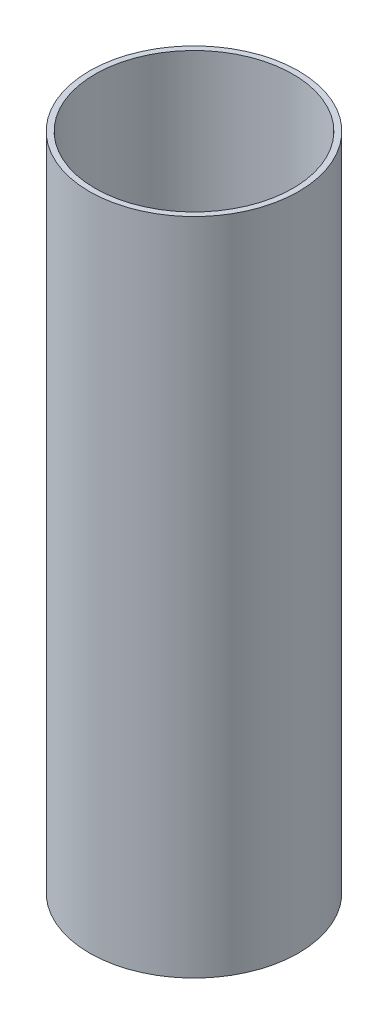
ISO-10303-21;
HEADER;
FILE_DESCRIPTION(('STEP AP214'),'2;1');
FILE_NAME('part.step','',(''),(''),'','','');
FILE_SCHEMA(('AUTOMOTIVE_DESIGN { 1 0 10303 214 1 1 1 1 }'));
ENDSEC;
DATA;
#1=APPLICATION_CONTEXT('core data for automotive mechanical design processes');
#2=APPLICATION_PROTOCOL_DEFINITION('international standard','automotive_design',2000,#1);
#3=PRODUCT_CONTEXT('',#1,'mechanical');
#4=PRODUCT('Part','Part','',(#3));
#5=PRODUCT_RELATED_PRODUCT_CATEGORY('part','',(#4));
#6=PRODUCT_DEFINITION_FORMATION('','',#4);
#7=PRODUCT_DEFINITION_CONTEXT('part definition',#1,'design');
#8=PRODUCT_DEFINITION('design','',#6,#7);
#9=PRODUCT_DEFINITION_SHAPE('','',#8);
#10=(LENGTH_UNIT() NAMED_UNIT(*) SI_UNIT(.MILLI.,.METRE.));
#11=(NAMED_UNIT(*) PLANE_ANGLE_UNIT() SI_UNIT($,.RADIAN.));
#12=(NAMED_UNIT(*) SI_UNIT($,.STERADIAN.) SOLID_ANGLE_UNIT());
#13=UNCERTAINTY_MEASURE_WITH_UNIT(LENGTH_MEASURE(1.E-05),#10,'distance_accuracy_value','');
#14=(GEOMETRIC_REPRESENTATION_CONTEXT(3) GLOBAL_UNCERTAINTY_ASSIGNED_CONTEXT((#13)) GLOBAL_UNIT_ASSIGNED_CONTEXT((#10,
#11,#12)) REPRESENTATION_CONTEXT('',''));
#15=CARTESIAN_POINT('',(0.,0.,0.));
#16=DIRECTION('',(0.,0.,1.));
#17=DIRECTION('',(1.,0.,0.));
#18=AXIS2_PLACEMENT_3D('',#15,#16,#17);
#19=CARTESIAN_POINT('',(0.,508.,0.));
#20=DIRECTION('',(0.,1.,0.));
#21=DIRECTION('',(0.,0.,1.));
#22=AXIS2_PLACEMENT_3D('',#19,#20,#21);
#23=PLANE('',#22);
#24=CARTESIAN_POINT('',(0.,508.,0.));
#25=DIRECTION('',(0.,1.,0.));
#26=DIRECTION('',(0.,0.,1.));
#27=AXIS2_PLACEMENT_3D('',#24,#25,#26);
#28=CIRCLE('',#27,80.518);
#29=CARTESIAN_POINT('',(0.,508.,80.518));
#30=VERTEX_POINT('',#29);
#31=EDGE_CURVE('E10',#30,#30,#28,.T.);
#32=ORIENTED_EDGE('',*,*,#31,.T.);
#33=EDGE_LOOP('',(#32));
#34=FACE_BOUND('',#33,.T.);
#35=CARTESIAN_POINT('',(0.,508.,0.));
#36=DIRECTION('',(0.,1.,0.));
#37=DIRECTION('',(0.,0.,1.));
#38=AXIS2_PLACEMENT_3D('',#35,#36,#37);
#39=CIRCLE('',#38,76.2);
#40=CARTESIAN_POINT('',(0.,508.,76.2));
#41=VERTEX_POINT('',#40);
#42=EDGE_CURVE('E45',#41,#41,#39,.T.);
#43=ORIENTED_EDGE('',*,*,#42,.F.);
#44=EDGE_LOOP('',(#43));
#45=FACE_BOUND('',#44,.T.);
#46=ADVANCED_FACE('F34',(#34,#45),#23,.T.);
#47=CARTESIAN_POINT('',(0.,0.,0.));
#48=DIRECTION('',(0.,1.,0.));
#49=DIRECTION('',(0.,0.,1.));
#50=AXIS2_PLACEMENT_3D('',#47,#48,#49);
#51=PLANE('',#50);
#52=CARTESIAN_POINT('',(0.,0.,0.));
#53=DIRECTION('',(0.,1.,0.));
#54=DIRECTION('',(0.,0.,1.));
#55=AXIS2_PLACEMENT_3D('',#52,#53,#54);
#56=CIRCLE('',#55,80.518);
#57=CARTESIAN_POINT('',(0.,0.,80.518));
#58=VERTEX_POINT('',#57);
#59=EDGE_CURVE('E38',#58,#58,#56,.T.);
#60=ORIENTED_EDGE('',*,*,#59,.F.);
#61=EDGE_LOOP('',(#60));
#62=FACE_BOUND('',#61,.T.);
#63=CARTESIAN_POINT('',(0.,0.,0.));
#64=DIRECTION('',(0.,1.,0.));
#65=DIRECTION('',(0.,0.,1.));
#66=AXIS2_PLACEMENT_3D('',#63,#64,#65);
#67=CIRCLE('',#66,76.2);
#68=CARTESIAN_POINT('',(0.,0.,76.2));
#69=VERTEX_POINT('',#68);
#70=EDGE_CURVE('E47',#69,#69,#67,.T.);
#71=ORIENTED_EDGE('',*,*,#70,.T.);
#72=EDGE_LOOP('',(#71));
#73=FACE_BOUND('',#72,.T.);
#74=ADVANCED_FACE('F57',(#62,#73),#51,.F.);
#75=CARTESIAN_POINT('',(0.,508.,0.));
#76=DIRECTION('',(0.,-1.,0.));
#77=DIRECTION('',(0.,0.,-1.));
#78=AXIS2_PLACEMENT_3D('',#75,#76,#77);
#79=CYLINDRICAL_SURFACE('',#78,80.518);
#80=ORIENTED_EDGE('',*,*,#31,.F.);
#81=EDGE_LOOP('',(#80));
#82=FACE_BOUND('',#81,.T.);
#83=ORIENTED_EDGE('',*,*,#59,.T.);
#84=EDGE_LOOP('',(#83));
#85=FACE_BOUND('',#84,.T.);
#86=ADVANCED_FACE('F36',(#82,#85),#79,.T.);
#87=CARTESIAN_POINT('',(0.,508.,0.));
#88=DIRECTION('',(0.,-1.,0.));
#89=DIRECTION('',(0.,0.,-1.));
#90=AXIS2_PLACEMENT_3D('',#87,#88,#89);
#91=CYLINDRICAL_SURFACE('',#90,76.2);
#92=ORIENTED_EDGE('',*,*,#42,.T.);
#93=EDGE_LOOP('',(#92));
#94=FACE_BOUND('',#93,.T.);
#95=ORIENTED_EDGE('',*,*,#70,.F.);
#96=EDGE_LOOP('',(#95));
#97=FACE_BOUND('',#96,.T.);
#98=ADVANCED_FACE('F53',(#94,#97),#91,.F.);
#99=CLOSED_SHELL('',(#46,#74,#86,#98));
#100=MANIFOLD_SOLID_BREP('B2',#99);
#101=ADVANCED_BREP_SHAPE_REPRESENTATION('',(#18,#100),#14);
#102=SHAPE_DEFINITION_REPRESENTATION(#9,#101);
ENDSEC;
END-ISO-10303-21;
